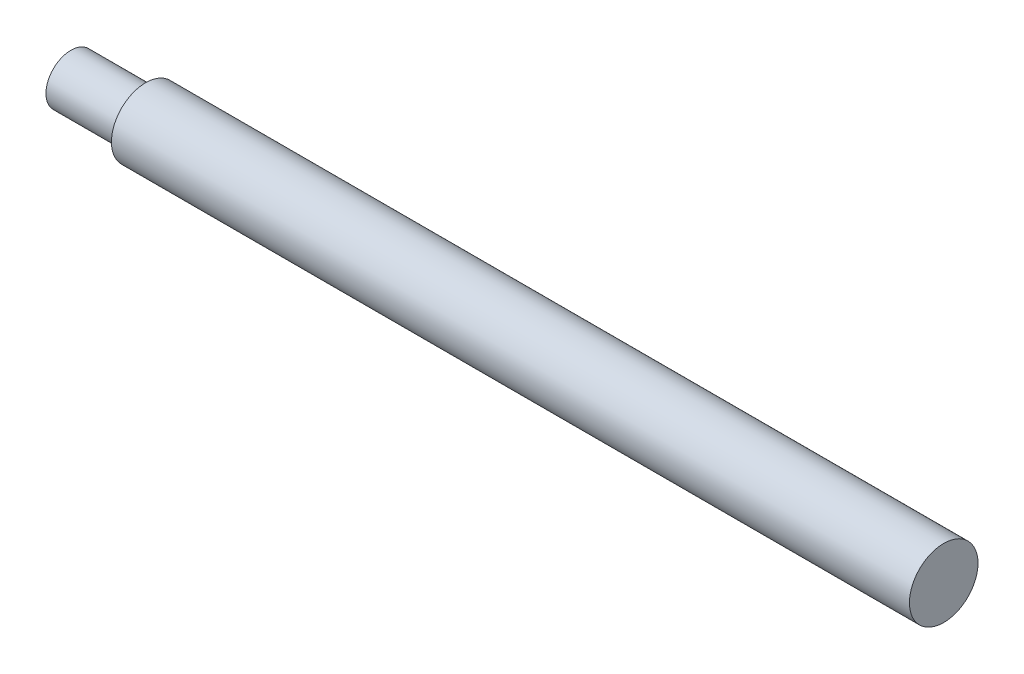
from build123d import *

# Parameters (mm, degrees)
SKETCH1_R           = 17.4625
BASE_EXTRUDE_DEPTH  = 406.4
SKETCH2_R           = 12.7
BOSS_EXTRUDE1_DEPTH = 38.1


with BuildPart() as part:
    # Sketch1 → Base-Extrude (new body)
    with BuildSketch(Plane(origin=(0, 0, 0), x_dir=(0, 0, -1), z_dir=(1, 0, 0))):
        Circle(SKETCH1_R)
    extrude(amount=-BASE_EXTRUDE_DEPTH)

    # Sketch2 → Boss-Extrude1 (add)
    with BuildSketch(Plane.ZY.offset(406.4)):
        with Locations(Location((0, 0, 0), (0, 0, 180))):
            Circle(SKETCH2_R)
    extrude(amount=BOSS_EXTRUDE1_DEPTH)


solid = part.part
